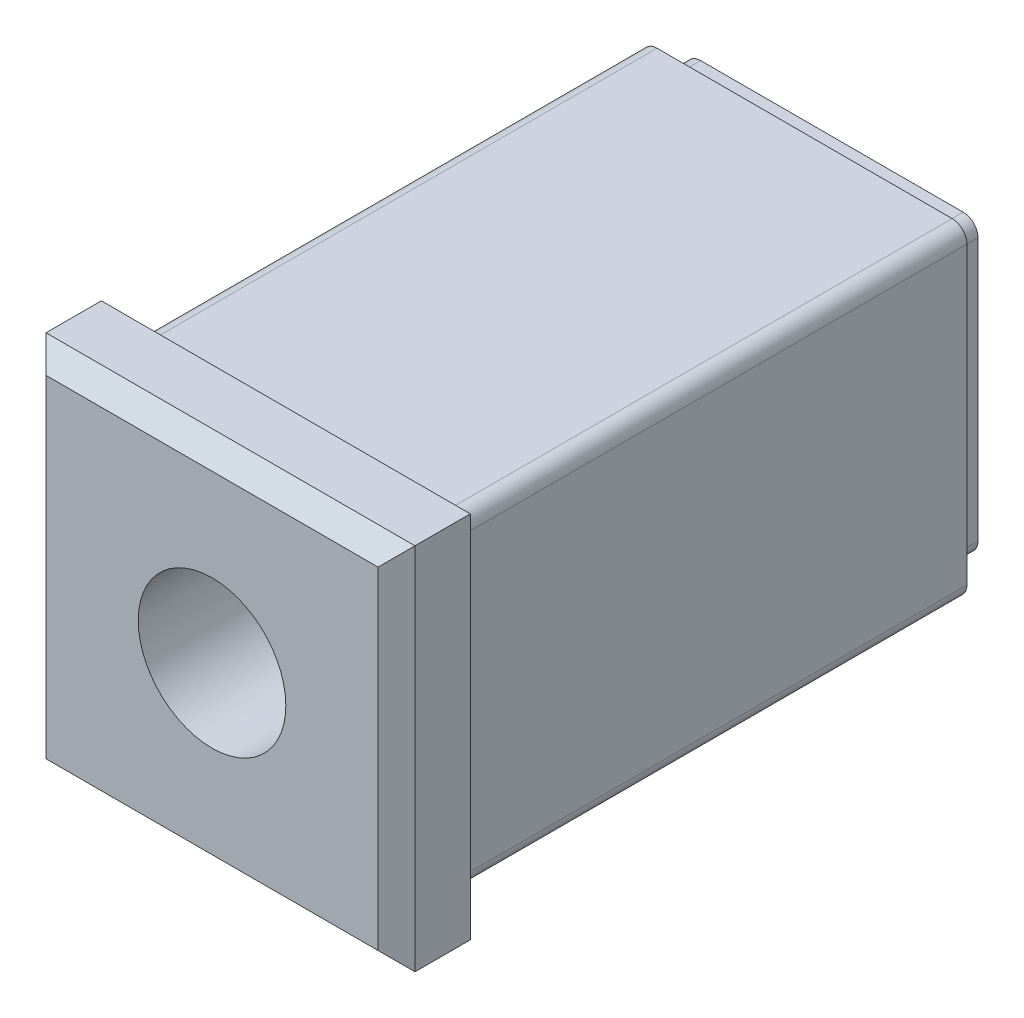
ISO-10303-21;
HEADER;
FILE_DESCRIPTION(('STEP AP214'),'2;1');
FILE_NAME('part.step','',(''),(''),'','','');
FILE_SCHEMA(('AUTOMOTIVE_DESIGN { 1 0 10303 214 1 1 1 1 }'));
ENDSEC;
DATA;
#1=APPLICATION_CONTEXT('core data for automotive mechanical design processes');
#2=APPLICATION_PROTOCOL_DEFINITION('international standard','automotive_design',2000,#1);
#3=PRODUCT_CONTEXT('',#1,'mechanical');
#4=PRODUCT('Part','Part','',(#3));
#5=PRODUCT_RELATED_PRODUCT_CATEGORY('part','',(#4));
#6=PRODUCT_DEFINITION_FORMATION('','',#4);
#7=PRODUCT_DEFINITION_CONTEXT('part definition',#1,'design');
#8=PRODUCT_DEFINITION('design','',#6,#7);
#9=PRODUCT_DEFINITION_SHAPE('','',#8);
#10=(LENGTH_UNIT() NAMED_UNIT(*) SI_UNIT(.MILLI.,.METRE.));
#11=(NAMED_UNIT(*) PLANE_ANGLE_UNIT() SI_UNIT($,.RADIAN.));
#12=(NAMED_UNIT(*) SI_UNIT($,.STERADIAN.) SOLID_ANGLE_UNIT());
#13=UNCERTAINTY_MEASURE_WITH_UNIT(LENGTH_MEASURE(1.E-05),#10,'distance_accuracy_value','');
#14=(GEOMETRIC_REPRESENTATION_CONTEXT(3) GLOBAL_UNCERTAINTY_ASSIGNED_CONTEXT((#13)) GLOBAL_UNIT_ASSIGNED_CONTEXT((#10,
#11,#12)) REPRESENTATION_CONTEXT('',''));
#15=CARTESIAN_POINT('',(0.,0.,0.));
#16=DIRECTION('',(0.,0.,1.));
#17=DIRECTION('',(1.,0.,0.));
#18=AXIS2_PLACEMENT_3D('',#15,#16,#17);
#19=CARTESIAN_POINT('',(11.25,0.,5.));
#20=DIRECTION('',(0.,0.,1.));
#21=DIRECTION('',(0.,1.,0.));
#22=AXIS2_PLACEMENT_3D('',#19,#20,#21);
#23=PLANE('',#22);
#24=DIRECTION('',(0.,-1.,0.));
#25=VECTOR('',#24,1.);
#26=CARTESIAN_POINT('',(-11.25,0.,5.));
#27=LINE('',#26,#25);
#28=CARTESIAN_POINT('',(-11.25,-11.25,5.));
#29=VERTEX_POINT('',#28);
#30=CARTESIAN_POINT('',(-11.25,11.25,5.));
#31=VERTEX_POINT('',#30);
#32=EDGE_CURVE('E237',#29,#31,#27,.F.);
#33=ORIENTED_EDGE('',*,*,#32,.F.);
#34=DIRECTION('',(-1.,0.,0.));
#35=VECTOR('',#34,1.);
#36=CARTESIAN_POINT('',(37.,-11.25,5.));
#37=LINE('',#36,#35);
#38=CARTESIAN_POINT('',(11.25,-11.25,5.));
#39=VERTEX_POINT('',#38);
#40=EDGE_CURVE('E188',#29,#39,#37,.F.);
#41=ORIENTED_EDGE('',*,*,#40,.T.);
#42=DIRECTION('',(0.,-1.,0.));
#43=VECTOR('',#42,1.);
#44=CARTESIAN_POINT('',(11.25,0.,5.));
#45=LINE('',#44,#43);
#46=CARTESIAN_POINT('',(11.25,11.25,5.));
#47=VERTEX_POINT('',#46);
#48=EDGE_CURVE('E347',#47,#39,#45,.T.);
#49=ORIENTED_EDGE('',*,*,#48,.F.);
#50=DIRECTION('',(-1.,0.,0.));
#51=VECTOR('',#50,1.);
#52=CARTESIAN_POINT('',(-25.,11.25,5.));
#53=LINE('',#52,#51);
#54=EDGE_CURVE('E360',#47,#31,#53,.T.);
#55=ORIENTED_EDGE('',*,*,#54,.T.);
#56=EDGE_LOOP('',(#33,#41,#49,#55));
#57=FACE_BOUND('',#56,.T.);
#58=CARTESIAN_POINT('',(0.,0.,5.));
#59=DIRECTION('',(0.,0.,1.));
#60=DIRECTION('',(0.,1.,0.));
#61=AXIS2_PLACEMENT_3D('',#58,#59,#60);
#62=CIRCLE('',#61,5.);
#63=CARTESIAN_POINT('',(0.,5.,5.));
#64=VERTEX_POINT('',#63);
#65=EDGE_CURVE('E191',#64,#64,#62,.F.);
#66=ORIENTED_EDGE('',*,*,#65,.T.);
#67=EDGE_LOOP('',(#66));
#68=FACE_BOUND('',#67,.T.);
#69=ADVANCED_FACE('F14',(#57,#68),#23,.T.);
#70=CARTESIAN_POINT('',(-25.,12.5,3.75));
#71=DIRECTION('',(0.,-0.707106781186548,-0.707106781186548));
#72=DIRECTION('',(0.,-0.707106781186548,0.707106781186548));
#73=AXIS2_PLACEMENT_3D('',#70,#71,#72);
#74=PLANE('',#73);
#75=DIRECTION('',(-1.,0.,0.));
#76=VECTOR('',#75,1.);
#77=CARTESIAN_POINT('',(0.,12.5,3.75));
#78=LINE('',#77,#76);
#79=CARTESIAN_POINT('',(12.5,12.5,3.75));
#80=VERTEX_POINT('',#79);
#81=CARTESIAN_POINT('',(-12.5,12.5,3.75));
#82=VERTEX_POINT('',#81);
#83=EDGE_CURVE('E338',#80,#82,#78,.T.);
#84=ORIENTED_EDGE('',*,*,#83,.T.);
#85=DIRECTION('',(-0.577350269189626,0.577350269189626,-0.577350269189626));
#86=VECTOR('',#85,1.);
#87=CARTESIAN_POINT('',(-11.25,11.25,5.));
#88=LINE('',#87,#86);
#89=EDGE_CURVE('E363',#31,#82,#88,.T.);
#90=ORIENTED_EDGE('',*,*,#89,.F.);
#91=ORIENTED_EDGE('',*,*,#54,.F.);
#92=DIRECTION('',(-0.577350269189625,-0.577350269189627,0.577350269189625));
#93=VECTOR('',#92,1.);
#94=CARTESIAN_POINT('',(12.5,12.5,3.75));
#95=LINE('',#94,#93);
#96=EDGE_CURVE('E349',#80,#47,#95,.T.);
#97=ORIENTED_EDGE('',*,*,#96,.F.);
#98=EDGE_LOOP('',(#84,#90,#91,#97));
#99=FACE_BOUND('',#98,.T.);
#100=ADVANCED_FACE('F441',(#99),#74,.F.);
#101=CARTESIAN_POINT('',(-11.25,0.,5.));
#102=DIRECTION('',(-0.707106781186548,0.,0.707106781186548));
#103=DIRECTION('',(-0.707106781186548,0.,-0.707106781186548));
#104=AXIS2_PLACEMENT_3D('',#101,#102,#103);
#105=PLANE('',#104);
#106=DIRECTION('',(0.,1.,0.));
#107=VECTOR('',#106,1.);
#108=CARTESIAN_POINT('',(-12.5,0.,3.75));
#109=LINE('',#108,#107);
#110=CARTESIAN_POINT('',(-12.5,-12.5,3.75));
#111=VERTEX_POINT('',#110);
#112=EDGE_CURVE('E18',#111,#82,#109,.T.);
#113=ORIENTED_EDGE('',*,*,#112,.F.);
#114=DIRECTION('',(0.577350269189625,0.577350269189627,0.577350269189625));
#115=VECTOR('',#114,1.);
#116=CARTESIAN_POINT('',(-12.5,-12.5,3.75));
#117=LINE('',#116,#115);
#118=EDGE_CURVE('E164',#111,#29,#117,.T.);
#119=ORIENTED_EDGE('',*,*,#118,.T.);
#120=ORIENTED_EDGE('',*,*,#32,.T.);
#121=ORIENTED_EDGE('',*,*,#89,.T.);
#122=EDGE_LOOP('',(#113,#119,#120,#121));
#123=FACE_BOUND('',#122,.T.);
#124=ADVANCED_FACE('F443',(#123),#105,.T.);
#125=CARTESIAN_POINT('',(12.5,0.,3.75));
#126=DIRECTION('',(0.707106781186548,0.,0.707106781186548));
#127=DIRECTION('',(-0.707106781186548,0.,0.707106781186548));
#128=AXIS2_PLACEMENT_3D('',#125,#126,#127);
#129=PLANE('',#128);
#130=ORIENTED_EDGE('',*,*,#48,.T.);
#131=DIRECTION('',(0.577350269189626,-0.577350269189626,-0.577350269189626));
#132=VECTOR('',#131,1.);
#133=CARTESIAN_POINT('',(11.25,-11.25,5.));
#134=LINE('',#133,#132);
#135=CARTESIAN_POINT('',(12.5,-12.5,3.75));
#136=VERTEX_POINT('',#135);
#137=EDGE_CURVE('E187',#39,#136,#134,.T.);
#138=ORIENTED_EDGE('',*,*,#137,.T.);
#139=DIRECTION('',(0.,-1.,0.));
#140=VECTOR('',#139,1.);
#141=CARTESIAN_POINT('',(12.5,0.,3.75));
#142=LINE('',#141,#140);
#143=EDGE_CURVE('E333',#80,#136,#142,.T.);
#144=ORIENTED_EDGE('',*,*,#143,.F.);
#145=ORIENTED_EDGE('',*,*,#96,.T.);
#146=EDGE_LOOP('',(#130,#138,#144,#145));
#147=FACE_BOUND('',#146,.T.);
#148=ADVANCED_FACE('F446',(#147),#129,.T.);
#149=CARTESIAN_POINT('',(-12.5,0.,-37.));
#150=DIRECTION('',(0.,0.,-1.));
#151=DIRECTION('',(0.,-1.,0.));
#152=AXIS2_PLACEMENT_3D('',#149,#150,#151);
#153=PLANE('',#152);
#154=DIRECTION('',(-1.,0.,0.));
#155=VECTOR('',#154,1.);
#156=CARTESIAN_POINT('',(-8.9,9.9,-37.));
#157=LINE('',#156,#155);
#158=CARTESIAN_POINT('',(-8.9,9.9,-37.));
#159=VERTEX_POINT('',#158);
#160=CARTESIAN_POINT('',(8.9,9.9,-37.));
#161=VERTEX_POINT('',#160);
#162=EDGE_CURVE('E322',#159,#161,#157,.F.);
#163=ORIENTED_EDGE('',*,*,#162,.T.);
#164=CARTESIAN_POINT('',(8.9,8.9,-37.));
#165=DIRECTION('',(0.,0.,1.));
#166=DIRECTION('',(0.,1.,0.));
#167=AXIS2_PLACEMENT_3D('',#164,#165,#166);
#168=CIRCLE('',#167,1.);
#169=CARTESIAN_POINT('',(9.9,8.9,-37.));
#170=VERTEX_POINT('',#169);
#171=EDGE_CURVE('E375',#161,#170,#168,.F.);
#172=ORIENTED_EDGE('',*,*,#171,.T.);
#173=DIRECTION('',(0.,1.,0.));
#174=VECTOR('',#173,1.);
#175=CARTESIAN_POINT('',(9.9,8.9,-37.));
#176=LINE('',#175,#174);
#177=CARTESIAN_POINT('',(9.9,-8.9,-37.));
#178=VERTEX_POINT('',#177);
#179=EDGE_CURVE('E327',#170,#178,#176,.F.);
#180=ORIENTED_EDGE('',*,*,#179,.T.);
#181=CARTESIAN_POINT('',(8.9,-8.9,-37.));
#182=DIRECTION('',(0.,0.,1.));
#183=DIRECTION('',(0.,1.,0.));
#184=AXIS2_PLACEMENT_3D('',#181,#182,#183);
#185=CIRCLE('',#184,1.);
#186=CARTESIAN_POINT('',(8.9,-9.9,-37.));
#187=VERTEX_POINT('',#186);
#188=EDGE_CURVE('E211',#178,#187,#185,.F.);
#189=ORIENTED_EDGE('',*,*,#188,.T.);
#190=DIRECTION('',(1.,0.,0.));
#191=VECTOR('',#190,1.);
#192=CARTESIAN_POINT('',(8.9,-9.9,-37.));
#193=LINE('',#192,#191);
#194=CARTESIAN_POINT('',(-8.9,-9.9,-37.));
#195=VERTEX_POINT('',#194);
#196=EDGE_CURVE('E181',#187,#195,#193,.F.);
#197=ORIENTED_EDGE('',*,*,#196,.T.);
#198=CARTESIAN_POINT('',(-8.9,-8.9,-37.));
#199=DIRECTION('',(0.,0.,1.));
#200=DIRECTION('',(0.,1.,0.));
#201=AXIS2_PLACEMENT_3D('',#198,#199,#200);
#202=CIRCLE('',#201,1.);
#203=CARTESIAN_POINT('',(-9.9,-8.9,-37.));
#204=VERTEX_POINT('',#203);
#205=EDGE_CURVE('E193',#195,#204,#202,.F.);
#206=ORIENTED_EDGE('',*,*,#205,.T.);
#207=DIRECTION('',(0.,-1.,0.));
#208=VECTOR('',#207,1.);
#209=CARTESIAN_POINT('',(-9.9,-8.9,-37.));
#210=LINE('',#209,#208);
#211=CARTESIAN_POINT('',(-9.9,8.9,-37.));
#212=VERTEX_POINT('',#211);
#213=EDGE_CURVE('E167',#204,#212,#210,.F.);
#214=ORIENTED_EDGE('',*,*,#213,.T.);
#215=CARTESIAN_POINT('',(-8.9,8.9,-37.));
#216=DIRECTION('',(0.,0.,1.));
#217=DIRECTION('',(0.,1.,0.));
#218=AXIS2_PLACEMENT_3D('',#215,#216,#217);
#219=CIRCLE('',#218,1.);
#220=EDGE_CURVE('E377',#212,#159,#219,.F.);
#221=ORIENTED_EDGE('',*,*,#220,.T.);
#222=EDGE_LOOP('',(#163,#172,#180,#189,#197,#206,#214,#221));
#223=FACE_BOUND('',#222,.T.);
#224=CARTESIAN_POINT('',(0.,0.,-37.));
#225=DIRECTION('',(0.,0.,-1.));
#226=DIRECTION('',(0.,-1.,0.));
#227=AXIS2_PLACEMENT_3D('',#224,#225,#226);
#228=CIRCLE('',#227,5.);
#229=CARTESIAN_POINT('',(0.,-5.,-37.));
#230=VERTEX_POINT('',#229);
#231=EDGE_CURVE('E651',#230,#230,#228,.T.);
#232=ORIENTED_EDGE('',*,*,#231,.F.);
#233=EDGE_LOOP('',(#232));
#234=FACE_BOUND('',#233,.T.);
#235=ADVANCED_FACE('F389',(#223,#234),#153,.T.);
#236=CARTESIAN_POINT('',(12.5,0.,-37.));
#237=DIRECTION('',(1.,0.,0.));
#238=DIRECTION('',(0.,-1.,0.));
#239=AXIS2_PLACEMENT_3D('',#236,#237,#238);
#240=PLANE('',#239);
#241=ORIENTED_EDGE('',*,*,#143,.T.);
#242=DIRECTION('',(0.,0.,-1.));
#243=VECTOR('',#242,1.);
#244=CARTESIAN_POINT('',(12.5,-12.5,5.));
#245=LINE('',#244,#243);
#246=CARTESIAN_POINT('',(12.5,-12.5,0.));
#247=VERTEX_POINT('',#246);
#248=EDGE_CURVE('E174',#136,#247,#245,.T.);
#249=ORIENTED_EDGE('',*,*,#248,.T.);
#250=DIRECTION('',(0.,-1.,0.));
#251=VECTOR('',#250,1.);
#252=CARTESIAN_POINT('',(12.5,0.,0.));
#253=LINE('',#252,#251);
#254=CARTESIAN_POINT('',(12.5,12.5,0.));
#255=VERTEX_POINT('',#254);
#256=EDGE_CURVE('E309',#255,#247,#253,.T.);
#257=ORIENTED_EDGE('',*,*,#256,.F.);
#258=DIRECTION('',(0.,0.,-1.));
#259=VECTOR('',#258,1.);
#260=CARTESIAN_POINT('',(12.5,12.5,-37.));
#261=LINE('',#260,#259);
#262=EDGE_CURVE('E337',#255,#80,#261,.F.);
#263=ORIENTED_EDGE('',*,*,#262,.T.);
#264=EDGE_LOOP('',(#241,#249,#257,#263));
#265=FACE_BOUND('',#264,.T.);
#266=ADVANCED_FACE('F467',(#265),#240,.T.);
#267=CARTESIAN_POINT('',(0.,12.5,5.));
#268=DIRECTION('',(0.,-1.,0.));
#269=DIRECTION('',(-1.,0.,0.));
#270=AXIS2_PLACEMENT_3D('',#267,#268,#269);
#271=PLANE('',#270);
#272=DIRECTION('',(0.,0.,-1.));
#273=VECTOR('',#272,1.);
#274=CARTESIAN_POINT('',(-12.5,12.5,5.));
#275=LINE('',#274,#273);
#276=CARTESIAN_POINT('',(-12.5,12.5,0.));
#277=VERTEX_POINT('',#276);
#278=EDGE_CURVE('E334',#82,#277,#275,.T.);
#279=ORIENTED_EDGE('',*,*,#278,.F.);
#280=ORIENTED_EDGE('',*,*,#83,.F.);
#281=ORIENTED_EDGE('',*,*,#262,.F.);
#282=DIRECTION('',(-1.,0.,0.));
#283=VECTOR('',#282,1.);
#284=CARTESIAN_POINT('',(0.,12.5,0.));
#285=LINE('',#284,#283);
#286=EDGE_CURVE('E312',#277,#255,#285,.F.);
#287=ORIENTED_EDGE('',*,*,#286,.F.);
#288=EDGE_LOOP('',(#279,#280,#281,#287));
#289=FACE_BOUND('',#288,.T.);
#290=ADVANCED_FACE('F470',(#289),#271,.F.);
#291=CARTESIAN_POINT('',(-12.5,0.,3.75));
#292=DIRECTION('',(-1.,0.,0.));
#293=DIRECTION('',(0.,1.,0.));
#294=AXIS2_PLACEMENT_3D('',#291,#292,#293);
#295=PLANE('',#294);
#296=ORIENTED_EDGE('',*,*,#112,.T.);
#297=ORIENTED_EDGE('',*,*,#278,.T.);
#298=DIRECTION('',(0.,-1.,0.));
#299=VECTOR('',#298,1.);
#300=CARTESIAN_POINT('',(-12.5,0.,0.));
#301=LINE('',#300,#299);
#302=CARTESIAN_POINT('',(-12.5,-12.5,0.));
#303=VERTEX_POINT('',#302);
#304=EDGE_CURVE('E315',#303,#277,#301,.F.);
#305=ORIENTED_EDGE('',*,*,#304,.F.);
#306=DIRECTION('',(0.,0.,-1.));
#307=VECTOR('',#306,1.);
#308=CARTESIAN_POINT('',(-12.5,-12.5,-37.));
#309=LINE('',#308,#307);
#310=EDGE_CURVE('E169',#303,#111,#309,.F.);
#311=ORIENTED_EDGE('',*,*,#310,.T.);
#312=EDGE_LOOP('',(#296,#297,#305,#311));
#313=FACE_BOUND('',#312,.T.);
#314=ADVANCED_FACE('F474',(#313),#295,.T.);
#315=CARTESIAN_POINT('',(-10.,11.,0.));
#316=DIRECTION('',(0.,-1.,0.));
#317=DIRECTION('',(-1.,0.,0.));
#318=AXIS2_PLACEMENT_3D('',#315,#316,#317);
#319=PLANE('',#318);
#320=DIRECTION('',(0.,0.,-1.));
#321=VECTOR('',#320,1.);
#322=CARTESIAN_POINT('',(-10.,11.,0.));
#323=LINE('',#322,#321);
#324=CARTESIAN_POINT('',(-10.,11.,0.));
#325=VERTEX_POINT('',#324);
#326=CARTESIAN_POINT('',(-10.,11.,-35.15));
#327=VERTEX_POINT('',#326);
#328=EDGE_CURVE('E24',#325,#327,#323,.T.);
#329=ORIENTED_EDGE('',*,*,#328,.F.);
#330=DIRECTION('',(-1.,0.,0.));
#331=VECTOR('',#330,1.);
#332=CARTESIAN_POINT('',(-10.,11.,0.));
#333=LINE('',#332,#331);
#334=CARTESIAN_POINT('',(10.,11.,0.));
#335=VERTEX_POINT('',#334);
#336=EDGE_CURVE('E279',#335,#325,#333,.T.);
#337=ORIENTED_EDGE('',*,*,#336,.F.);
#338=DIRECTION('',(0.,0.,-1.));
#339=VECTOR('',#338,1.);
#340=CARTESIAN_POINT('',(10.,11.,0.));
#341=LINE('',#340,#339);
#342=CARTESIAN_POINT('',(10.,11.,-35.15));
#343=VERTEX_POINT('',#342);
#344=EDGE_CURVE('E276',#343,#335,#341,.F.);
#345=ORIENTED_EDGE('',*,*,#344,.F.);
#346=DIRECTION('',(-1.,0.,0.));
#347=VECTOR('',#346,1.);
#348=CARTESIAN_POINT('',(-10.,11.,-35.15));
#349=LINE('',#348,#347);
#350=EDGE_CURVE('E9',#327,#343,#349,.F.);
#351=ORIENTED_EDGE('',*,*,#350,.F.);
#352=EDGE_LOOP('',(#329,#337,#345,#351));
#353=FACE_BOUND('',#352,.T.);
#354=ADVANCED_FACE('F477',(#353),#319,.F.);
#355=CARTESIAN_POINT('',(-10.,10.,0.));
#356=DIRECTION('',(0.,0.,1.));
#357=DIRECTION('',(0.,1.,0.));
#358=AXIS2_PLACEMENT_3D('',#355,#356,#357);
#359=CYLINDRICAL_SURFACE('',#358,1.);
#360=CARTESIAN_POINT('',(-10.,10.,0.));
#361=DIRECTION('',(0.,0.,1.));
#362=DIRECTION('',(0.,1.,0.));
#363=AXIS2_PLACEMENT_3D('',#360,#361,#362);
#364=CIRCLE('',#363,1.);
#365=CARTESIAN_POINT('',(-11.,10.,0.));
#366=VERTEX_POINT('',#365);
#367=EDGE_CURVE('E295',#366,#325,#364,.F.);
#368=ORIENTED_EDGE('',*,*,#367,.T.);
#369=ORIENTED_EDGE('',*,*,#328,.T.);
#370=CARTESIAN_POINT('',(-10.,10.,-35.15));
#371=DIRECTION('',(0.,0.,1.));
#372=DIRECTION('',(0.,1.,0.));
#373=AXIS2_PLACEMENT_3D('',#370,#371,#372);
#374=CIRCLE('',#373,1.);
#375=CARTESIAN_POINT('',(-11.,10.,-35.15));
#376=VERTEX_POINT('',#375);
#377=EDGE_CURVE('E32',#376,#327,#374,.F.);
#378=ORIENTED_EDGE('',*,*,#377,.F.);
#379=DIRECTION('',(0.,0.,1.));
#380=VECTOR('',#379,1.);
#381=CARTESIAN_POINT('',(-11.,10.,0.));
#382=LINE('',#381,#380);
#383=EDGE_CURVE('E304',#376,#366,#382,.T.);
#384=ORIENTED_EDGE('',*,*,#383,.T.);
#385=EDGE_LOOP('',(#368,#369,#378,#384));
#386=FACE_BOUND('',#385,.T.);
#387=ADVANCED_FACE('F512',(#386),#359,.T.);
#388=CARTESIAN_POINT('',(-11.,-10.,0.));
#389=DIRECTION('',(1.,0.,0.));
#390=DIRECTION('',(0.,-1.,0.));
#391=AXIS2_PLACEMENT_3D('',#388,#389,#390);
#392=PLANE('',#391);
#393=DIRECTION('',(0.,-1.,0.));
#394=VECTOR('',#393,1.);
#395=CARTESIAN_POINT('',(-11.,0.,-35.15));
#396=LINE('',#395,#394);
#397=CARTESIAN_POINT('',(-11.,-10.,-35.15));
#398=VERTEX_POINT('',#397);
#399=EDGE_CURVE('E153',#398,#376,#396,.F.);
#400=ORIENTED_EDGE('',*,*,#399,.F.);
#401=DIRECTION('',(0.,0.,1.));
#402=VECTOR('',#401,1.);
#403=CARTESIAN_POINT('',(-11.,-10.,0.));
#404=LINE('',#403,#402);
#405=CARTESIAN_POINT('',(-11.,-10.,0.));
#406=VERTEX_POINT('',#405);
#407=EDGE_CURVE('E244',#406,#398,#404,.F.);
#408=ORIENTED_EDGE('',*,*,#407,.F.);
#409=DIRECTION('',(0.,-1.,0.));
#410=VECTOR('',#409,1.);
#411=CARTESIAN_POINT('',(-11.,0.,0.));
#412=LINE('',#411,#410);
#413=EDGE_CURVE('E302',#366,#406,#412,.T.);
#414=ORIENTED_EDGE('',*,*,#413,.F.);
#415=ORIENTED_EDGE('',*,*,#383,.F.);
#416=EDGE_LOOP('',(#400,#408,#414,#415));
#417=FACE_BOUND('',#416,.T.);
#418=ADVANCED_FACE('F405',(#417),#392,.F.);
#419=CARTESIAN_POINT('',(-9.9,-8.9,-35.15));
#420=DIRECTION('',(1.,0.,0.));
#421=DIRECTION('',(0.,-1.,0.));
#422=AXIS2_PLACEMENT_3D('',#419,#420,#421);
#423=PLANE('',#422);
#424=ORIENTED_EDGE('',*,*,#213,.F.);
#425=DIRECTION('',(0.,0.,-1.));
#426=VECTOR('',#425,1.);
#427=CARTESIAN_POINT('',(-9.9,-8.9,-35.15));
#428=LINE('',#427,#426);
#429=CARTESIAN_POINT('',(-9.9,-8.9,-35.15));
#430=VERTEX_POINT('',#429);
#431=EDGE_CURVE('E160',#430,#204,#428,.T.);
#432=ORIENTED_EDGE('',*,*,#431,.F.);
#433=DIRECTION('',(0.,-1.,0.));
#434=VECTOR('',#433,1.);
#435=CARTESIAN_POINT('',(-9.9,0.,-35.15));
#436=LINE('',#435,#434);
#437=CARTESIAN_POINT('',(-9.9,8.9,-35.15));
#438=VERTEX_POINT('',#437);
#439=EDGE_CURVE('E146',#438,#430,#436,.T.);
#440=ORIENTED_EDGE('',*,*,#439,.F.);
#441=DIRECTION('',(0.,0.,-1.));
#442=VECTOR('',#441,1.);
#443=CARTESIAN_POINT('',(-9.9,8.9,-35.15));
#444=LINE('',#443,#442);
#445=EDGE_CURVE('E320',#212,#438,#444,.F.);
#446=ORIENTED_EDGE('',*,*,#445,.F.);
#447=EDGE_LOOP('',(#424,#432,#440,#446));
#448=FACE_BOUND('',#447,.T.);
#449=ADVANCED_FACE('F165',(#448),#423,.F.);
#450=CARTESIAN_POINT('',(-8.9,8.9,-35.15));
#451=DIRECTION('',(0.,0.,1.));
#452=DIRECTION('',(0.,1.,0.));
#453=AXIS2_PLACEMENT_3D('',#450,#451,#452);
#454=CYLINDRICAL_SURFACE('',#453,1.);
#455=CARTESIAN_POINT('',(-8.9,8.9,-35.15));
#456=DIRECTION('',(0.,0.,1.));
#457=DIRECTION('',(0.,1.,0.));
#458=AXIS2_PLACEMENT_3D('',#455,#456,#457);
#459=CIRCLE('',#458,1.);
#460=CARTESIAN_POINT('',(-8.9,9.9,-35.15));
#461=VERTEX_POINT('',#460);
#462=EDGE_CURVE('E149',#438,#461,#459,.F.);
#463=ORIENTED_EDGE('',*,*,#462,.T.);
#464=DIRECTION('',(0.,0.,-1.));
#465=VECTOR('',#464,1.);
#466=CARTESIAN_POINT('',(-8.9,9.9,-35.15));
#467=LINE('',#466,#465);
#468=EDGE_CURVE('E326',#461,#159,#467,.T.);
#469=ORIENTED_EDGE('',*,*,#468,.T.);
#470=ORIENTED_EDGE('',*,*,#220,.F.);
#471=ORIENTED_EDGE('',*,*,#445,.T.);
#472=EDGE_LOOP('',(#463,#469,#470,#471));
#473=FACE_BOUND('',#472,.T.);
#474=ADVANCED_FACE('F395',(#473),#454,.T.);
#475=CARTESIAN_POINT('',(-8.9,9.9,-35.15));
#476=DIRECTION('',(0.,-1.,0.));
#477=DIRECTION('',(-1.,0.,0.));
#478=AXIS2_PLACEMENT_3D('',#475,#476,#477);
#479=PLANE('',#478);
#480=ORIENTED_EDGE('',*,*,#468,.F.);
#481=DIRECTION('',(-1.,0.,0.));
#482=VECTOR('',#481,1.);
#483=CARTESIAN_POINT('',(0.,9.9,-35.15));
#484=LINE('',#483,#482);
#485=CARTESIAN_POINT('',(8.9,9.9,-35.15));
#486=VERTEX_POINT('',#485);
#487=EDGE_CURVE('E154',#486,#461,#484,.T.);
#488=ORIENTED_EDGE('',*,*,#487,.F.);
#489=DIRECTION('',(0.,0.,-1.));
#490=VECTOR('',#489,1.);
#491=CARTESIAN_POINT('',(8.9,9.9,-35.15));
#492=LINE('',#491,#490);
#493=EDGE_CURVE('E323',#161,#486,#492,.F.);
#494=ORIENTED_EDGE('',*,*,#493,.F.);
#495=ORIENTED_EDGE('',*,*,#162,.F.);
#496=EDGE_LOOP('',(#480,#488,#494,#495));
#497=FACE_BOUND('',#496,.T.);
#498=ADVANCED_FACE('F394',(#497),#479,.F.);
#499=CARTESIAN_POINT('',(8.9,8.9,-35.15));
#500=DIRECTION('',(0.,0.,1.));
#501=DIRECTION('',(0.,1.,0.));
#502=AXIS2_PLACEMENT_3D('',#499,#500,#501);
#503=CYLINDRICAL_SURFACE('',#502,1.);
#504=CARTESIAN_POINT('',(8.9,8.9,-35.15));
#505=DIRECTION('',(0.,0.,1.));
#506=DIRECTION('',(0.,1.,0.));
#507=AXIS2_PLACEMENT_3D('',#504,#505,#506);
#508=CIRCLE('',#507,1.);
#509=CARTESIAN_POINT('',(9.9,8.9,-35.15));
#510=VERTEX_POINT('',#509);
#511=EDGE_CURVE('E228',#486,#510,#508,.F.);
#512=ORIENTED_EDGE('',*,*,#511,.T.);
#513=DIRECTION('',(0.,0.,-1.));
#514=VECTOR('',#513,1.);
#515=CARTESIAN_POINT('',(9.9,8.9,-35.15));
#516=LINE('',#515,#514);
#517=EDGE_CURVE('E330',#510,#170,#516,.T.);
#518=ORIENTED_EDGE('',*,*,#517,.T.);
#519=ORIENTED_EDGE('',*,*,#171,.F.);
#520=ORIENTED_EDGE('',*,*,#493,.T.);
#521=EDGE_LOOP('',(#512,#518,#519,#520));
#522=FACE_BOUND('',#521,.T.);
#523=ADVANCED_FACE('F382',(#522),#503,.T.);
#524=CARTESIAN_POINT('',(9.9,8.9,-35.15));
#525=DIRECTION('',(-1.,0.,0.));
#526=DIRECTION('',(0.,1.,0.));
#527=AXIS2_PLACEMENT_3D('',#524,#525,#526);
#528=PLANE('',#527);
#529=ORIENTED_EDGE('',*,*,#517,.F.);
#530=DIRECTION('',(0.,-1.,0.));
#531=VECTOR('',#530,1.);
#532=CARTESIAN_POINT('',(9.9,0.,-35.15));
#533=LINE('',#532,#531);
#534=CARTESIAN_POINT('',(9.9,-8.9,-35.15));
#535=VERTEX_POINT('',#534);
#536=EDGE_CURVE('E293',#535,#510,#533,.F.);
#537=ORIENTED_EDGE('',*,*,#536,.F.);
#538=DIRECTION('',(0.,0.,-1.));
#539=VECTOR('',#538,1.);
#540=CARTESIAN_POINT('',(9.9,-8.9,-35.15));
#541=LINE('',#540,#539);
#542=EDGE_CURVE('E184',#178,#535,#541,.F.);
#543=ORIENTED_EDGE('',*,*,#542,.F.);
#544=ORIENTED_EDGE('',*,*,#179,.F.);
#545=EDGE_LOOP('',(#529,#537,#543,#544));
#546=FACE_BOUND('',#545,.T.);
#547=ADVANCED_FACE('F387',(#546),#528,.F.);
#548=CARTESIAN_POINT('',(11.,10.,0.));
#549=DIRECTION('',(-1.,0.,0.));
#550=DIRECTION('',(0.,1.,0.));
#551=AXIS2_PLACEMENT_3D('',#548,#549,#550);
#552=PLANE('',#551);
#553=DIRECTION('',(0.,0.,1.));
#554=VECTOR('',#553,1.);
#555=CARTESIAN_POINT('',(11.,10.,0.));
#556=LINE('',#555,#554);
#557=CARTESIAN_POINT('',(11.,10.,0.));
#558=VERTEX_POINT('',#557);
#559=CARTESIAN_POINT('',(11.,10.,-35.15));
#560=VERTEX_POINT('',#559);
#561=EDGE_CURVE('E316',#558,#560,#556,.F.);
#562=ORIENTED_EDGE('',*,*,#561,.F.);
#563=DIRECTION('',(0.,-1.,0.));
#564=VECTOR('',#563,1.);
#565=CARTESIAN_POINT('',(11.,0.,0.));
#566=LINE('',#565,#564);
#567=CARTESIAN_POINT('',(11.,-10.,0.));
#568=VERTEX_POINT('',#567);
#569=EDGE_CURVE('E260',#568,#558,#566,.F.);
#570=ORIENTED_EDGE('',*,*,#569,.F.);
#571=DIRECTION('',(0.,0.,1.));
#572=VECTOR('',#571,1.);
#573=CARTESIAN_POINT('',(11.,-10.,0.));
#574=LINE('',#573,#572);
#575=CARTESIAN_POINT('',(11.,-10.,-35.15));
#576=VERTEX_POINT('',#575);
#577=EDGE_CURVE('E206',#576,#568,#574,.T.);
#578=ORIENTED_EDGE('',*,*,#577,.F.);
#579=DIRECTION('',(0.,-1.,0.));
#580=VECTOR('',#579,1.);
#581=CARTESIAN_POINT('',(11.,0.,-35.15));
#582=LINE('',#581,#580);
#583=EDGE_CURVE('E272',#560,#576,#582,.T.);
#584=ORIENTED_EDGE('',*,*,#583,.F.);
#585=EDGE_LOOP('',(#562,#570,#578,#584));
#586=FACE_BOUND('',#585,.T.);
#587=ADVANCED_FACE('F458',(#586),#552,.F.);
#588=CARTESIAN_POINT('',(10.,10.,0.));
#589=DIRECTION('',(0.,0.,1.));
#590=DIRECTION('',(0.,1.,0.));
#591=AXIS2_PLACEMENT_3D('',#588,#589,#590);
#592=CYLINDRICAL_SURFACE('',#591,1.);
#593=CARTESIAN_POINT('',(10.,10.,0.));
#594=DIRECTION('',(0.,0.,1.));
#595=DIRECTION('',(0.,1.,0.));
#596=AXIS2_PLACEMENT_3D('',#593,#594,#595);
#597=CIRCLE('',#596,1.);
#598=EDGE_CURVE('E305',#558,#335,#597,.T.);
#599=ORIENTED_EDGE('',*,*,#598,.F.);
#600=ORIENTED_EDGE('',*,*,#561,.T.);
#601=CARTESIAN_POINT('',(10.,10.,-35.15));
#602=DIRECTION('',(0.,0.,1.));
#603=DIRECTION('',(0.,1.,0.));
#604=AXIS2_PLACEMENT_3D('',#601,#602,#603);
#605=CIRCLE('',#604,1.);
#606=EDGE_CURVE('E275',#343,#560,#605,.F.);
#607=ORIENTED_EDGE('',*,*,#606,.F.);
#608=ORIENTED_EDGE('',*,*,#344,.T.);
#609=EDGE_LOOP('',(#599,#600,#607,#608));
#610=FACE_BOUND('',#609,.T.);
#611=ADVANCED_FACE('F464',(#610),#592,.T.);
#612=CARTESIAN_POINT('',(0.,0.,-35.15));
#613=DIRECTION('',(0.,0.,-1.));
#614=DIRECTION('',(0.,-1.,0.));
#615=AXIS2_PLACEMENT_3D('',#612,#613,#614);
#616=PLANE('',#615);
#617=ORIENTED_EDGE('',*,*,#439,.T.);
#618=CARTESIAN_POINT('',(-8.9,-8.9,-35.15));
#619=DIRECTION('',(0.,0.,1.));
#620=DIRECTION('',(0.,1.,0.));
#621=AXIS2_PLACEMENT_3D('',#618,#619,#620);
#622=CIRCLE('',#621,1.);
#623=CARTESIAN_POINT('',(-8.9,-9.9,-35.15));
#624=VERTEX_POINT('',#623);
#625=EDGE_CURVE('E143',#624,#430,#622,.F.);
#626=ORIENTED_EDGE('',*,*,#625,.F.);
#627=DIRECTION('',(-1.,0.,0.));
#628=VECTOR('',#627,1.);
#629=CARTESIAN_POINT('',(0.,-9.9,-35.15));
#630=LINE('',#629,#628);
#631=CARTESIAN_POINT('',(8.9,-9.9,-35.15));
#632=VERTEX_POINT('',#631);
#633=EDGE_CURVE('E203',#624,#632,#630,.F.);
#634=ORIENTED_EDGE('',*,*,#633,.T.);
#635=CARTESIAN_POINT('',(8.9,-8.9,-35.15));
#636=DIRECTION('',(0.,0.,1.));
#637=DIRECTION('',(0.,1.,0.));
#638=AXIS2_PLACEMENT_3D('',#635,#636,#637);
#639=CIRCLE('',#638,1.);
#640=EDGE_CURVE('E163',#535,#632,#639,.F.);
#641=ORIENTED_EDGE('',*,*,#640,.F.);
#642=ORIENTED_EDGE('',*,*,#536,.T.);
#643=ORIENTED_EDGE('',*,*,#511,.F.);
#644=ORIENTED_EDGE('',*,*,#487,.T.);
#645=ORIENTED_EDGE('',*,*,#462,.F.);
#646=EDGE_LOOP('',(#617,#626,#634,#641,#642,#643,#644,#645));
#647=FACE_BOUND('',#646,.T.);
#648=ORIENTED_EDGE('',*,*,#606,.T.);
#649=ORIENTED_EDGE('',*,*,#583,.T.);
#650=CARTESIAN_POINT('',(10.,-10.,-35.15));
#651=DIRECTION('',(0.,0.,1.));
#652=DIRECTION('',(0.,1.,0.));
#653=AXIS2_PLACEMENT_3D('',#650,#651,#652);
#654=CIRCLE('',#653,1.);
#655=CARTESIAN_POINT('',(10.,-11.,-35.15));
#656=VERTEX_POINT('',#655);
#657=EDGE_CURVE('E201',#576,#656,#654,.F.);
#658=ORIENTED_EDGE('',*,*,#657,.T.);
#659=DIRECTION('',(1.,0.,0.));
#660=VECTOR('',#659,1.);
#661=CARTESIAN_POINT('',(10.,-11.,-35.15));
#662=LINE('',#661,#660);
#663=CARTESIAN_POINT('',(-10.,-11.,-35.15));
#664=VERTEX_POINT('',#663);
#665=EDGE_CURVE('E233',#656,#664,#662,.F.);
#666=ORIENTED_EDGE('',*,*,#665,.T.);
#667=CARTESIAN_POINT('',(-10.,-10.,-35.15));
#668=DIRECTION('',(0.,0.,1.));
#669=DIRECTION('',(0.,1.,0.));
#670=AXIS2_PLACEMENT_3D('',#667,#668,#669);
#671=CIRCLE('',#670,1.);
#672=EDGE_CURVE('E197',#664,#398,#671,.F.);
#673=ORIENTED_EDGE('',*,*,#672,.T.);
#674=ORIENTED_EDGE('',*,*,#399,.T.);
#675=ORIENTED_EDGE('',*,*,#377,.T.);
#676=ORIENTED_EDGE('',*,*,#350,.T.);
#677=EDGE_LOOP('',(#648,#649,#658,#666,#673,#674,#675,#676));
#678=FACE_BOUND('',#677,.T.);
#679=ADVANCED_FACE('F147',(#647,#678),#616,.T.);
#680=CARTESIAN_POINT('',(0.,0.,0.));
#681=DIRECTION('',(0.,0.,-1.));
#682=DIRECTION('',(0.,-1.,0.));
#683=AXIS2_PLACEMENT_3D('',#680,#681,#682);
#684=PLANE('',#683);
#685=ORIENTED_EDGE('',*,*,#413,.T.);
#686=CARTESIAN_POINT('',(-10.,-10.,0.));
#687=DIRECTION('',(0.,0.,1.));
#688=DIRECTION('',(0.,1.,0.));
#689=AXIS2_PLACEMENT_3D('',#686,#687,#688);
#690=CIRCLE('',#689,1.);
#691=CARTESIAN_POINT('',(-10.,-11.,0.));
#692=VERTEX_POINT('',#691);
#693=EDGE_CURVE('E207',#406,#692,#690,.T.);
#694=ORIENTED_EDGE('',*,*,#693,.T.);
#695=DIRECTION('',(1.,0.,0.));
#696=VECTOR('',#695,1.);
#697=CARTESIAN_POINT('',(10.,-11.,0.));
#698=LINE('',#697,#696);
#699=CARTESIAN_POINT('',(10.,-11.,0.));
#700=VERTEX_POINT('',#699);
#701=EDGE_CURVE('E234',#692,#700,#698,.T.);
#702=ORIENTED_EDGE('',*,*,#701,.T.);
#703=CARTESIAN_POINT('',(10.,-10.,0.));
#704=DIRECTION('',(0.,0.,1.));
#705=DIRECTION('',(0.,1.,0.));
#706=AXIS2_PLACEMENT_3D('',#703,#704,#705);
#707=CIRCLE('',#706,1.);
#708=EDGE_CURVE('E204',#568,#700,#707,.F.);
#709=ORIENTED_EDGE('',*,*,#708,.F.);
#710=ORIENTED_EDGE('',*,*,#569,.T.);
#711=ORIENTED_EDGE('',*,*,#598,.T.);
#712=ORIENTED_EDGE('',*,*,#336,.T.);
#713=ORIENTED_EDGE('',*,*,#367,.F.);
#714=EDGE_LOOP('',(#685,#694,#702,#709,#710,#711,#712,#713));
#715=FACE_BOUND('',#714,.T.);
#716=DIRECTION('',(-1.,0.,0.));
#717=VECTOR('',#716,1.);
#718=CARTESIAN_POINT('',(0.,-12.5,0.));
#719=LINE('',#718,#717);
#720=EDGE_CURVE('E209',#247,#303,#719,.T.);
#721=ORIENTED_EDGE('',*,*,#720,.T.);
#722=ORIENTED_EDGE('',*,*,#304,.T.);
#723=ORIENTED_EDGE('',*,*,#286,.T.);
#724=ORIENTED_EDGE('',*,*,#256,.T.);
#725=EDGE_LOOP('',(#721,#722,#723,#724));
#726=FACE_BOUND('',#725,.T.);
#727=ADVANCED_FACE('F258',(#715,#726),#684,.T.);
#728=CARTESIAN_POINT('',(37.,-12.5,3.75));
#729=DIRECTION('',(0.,0.707106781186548,-0.707106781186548));
#730=DIRECTION('',(0.,-0.707106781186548,-0.707106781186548));
#731=AXIS2_PLACEMENT_3D('',#728,#729,#730);
#732=PLANE('',#731);
#733=DIRECTION('',(1.,0.,0.));
#734=VECTOR('',#733,1.);
#735=CARTESIAN_POINT('',(0.,-12.5,3.75));
#736=LINE('',#735,#734);
#737=EDGE_CURVE('E180',#111,#136,#736,.T.);
#738=ORIENTED_EDGE('',*,*,#737,.T.);
#739=ORIENTED_EDGE('',*,*,#137,.F.);
#740=ORIENTED_EDGE('',*,*,#40,.F.);
#741=ORIENTED_EDGE('',*,*,#118,.F.);
#742=EDGE_LOOP('',(#738,#739,#740,#741));
#743=FACE_BOUND('',#742,.T.);
#744=ADVANCED_FACE('F16',(#743),#732,.F.);
#745=CARTESIAN_POINT('',(0.,-12.5,5.));
#746=DIRECTION('',(0.,1.,0.));
#747=DIRECTION('',(1.,0.,0.));
#748=AXIS2_PLACEMENT_3D('',#745,#746,#747);
#749=PLANE('',#748);
#750=ORIENTED_EDGE('',*,*,#248,.F.);
#751=ORIENTED_EDGE('',*,*,#737,.F.);
#752=ORIENTED_EDGE('',*,*,#310,.F.);
#753=ORIENTED_EDGE('',*,*,#720,.F.);
#754=EDGE_LOOP('',(#750,#751,#752,#753));
#755=FACE_BOUND('',#754,.T.);
#756=ADVANCED_FACE('F410',(#755),#749,.F.);
#757=CARTESIAN_POINT('',(10.,-11.,0.));
#758=DIRECTION('',(0.,1.,0.));
#759=DIRECTION('',(1.,0.,0.));
#760=AXIS2_PLACEMENT_3D('',#757,#758,#759);
#761=PLANE('',#760);
#762=DIRECTION('',(0.,0.,-1.));
#763=VECTOR('',#762,1.);
#764=CARTESIAN_POINT('',(10.,-11.,0.));
#765=LINE('',#764,#763);
#766=EDGE_CURVE('E230',#700,#656,#765,.T.);
#767=ORIENTED_EDGE('',*,*,#766,.F.);
#768=ORIENTED_EDGE('',*,*,#701,.F.);
#769=DIRECTION('',(0.,0.,-1.));
#770=VECTOR('',#769,1.);
#771=CARTESIAN_POINT('',(-10.,-11.,0.));
#772=LINE('',#771,#770);
#773=EDGE_CURVE('E200',#664,#692,#772,.F.);
#774=ORIENTED_EDGE('',*,*,#773,.F.);
#775=ORIENTED_EDGE('',*,*,#665,.F.);
#776=EDGE_LOOP('',(#767,#768,#774,#775));
#777=FACE_BOUND('',#776,.T.);
#778=ADVANCED_FACE('F265',(#777),#761,.F.);
#779=CARTESIAN_POINT('',(10.,-10.,0.));
#780=DIRECTION('',(0.,0.,1.));
#781=DIRECTION('',(0.,1.,0.));
#782=AXIS2_PLACEMENT_3D('',#779,#780,#781);
#783=CYLINDRICAL_SURFACE('',#782,1.);
#784=ORIENTED_EDGE('',*,*,#708,.T.);
#785=ORIENTED_EDGE('',*,*,#766,.T.);
#786=ORIENTED_EDGE('',*,*,#657,.F.);
#787=ORIENTED_EDGE('',*,*,#577,.T.);
#788=EDGE_LOOP('',(#784,#785,#786,#787));
#789=FACE_BOUND('',#788,.T.);
#790=ADVANCED_FACE('F253',(#789),#783,.T.);
#791=CARTESIAN_POINT('',(8.9,-8.9,-35.15));
#792=DIRECTION('',(0.,0.,1.));
#793=DIRECTION('',(0.,1.,0.));
#794=AXIS2_PLACEMENT_3D('',#791,#792,#793);
#795=CYLINDRICAL_SURFACE('',#794,1.);
#796=ORIENTED_EDGE('',*,*,#640,.T.);
#797=DIRECTION('',(0.,0.,-1.));
#798=VECTOR('',#797,1.);
#799=CARTESIAN_POINT('',(8.9,-9.9,-35.15));
#800=LINE('',#799,#798);
#801=EDGE_CURVE('E171',#632,#187,#800,.T.);
#802=ORIENTED_EDGE('',*,*,#801,.T.);
#803=ORIENTED_EDGE('',*,*,#188,.F.);
#804=ORIENTED_EDGE('',*,*,#542,.T.);
#805=EDGE_LOOP('',(#796,#802,#803,#804));
#806=FACE_BOUND('',#805,.T.);
#807=ADVANCED_FACE('F218',(#806),#795,.T.);
#808=CARTESIAN_POINT('',(8.9,-9.9,-35.15));
#809=DIRECTION('',(0.,1.,0.));
#810=DIRECTION('',(1.,0.,0.));
#811=AXIS2_PLACEMENT_3D('',#808,#809,#810);
#812=PLANE('',#811);
#813=ORIENTED_EDGE('',*,*,#801,.F.);
#814=ORIENTED_EDGE('',*,*,#633,.F.);
#815=DIRECTION('',(0.,0.,-1.));
#816=VECTOR('',#815,1.);
#817=CARTESIAN_POINT('',(-8.9,-9.9,-35.15));
#818=LINE('',#817,#816);
#819=EDGE_CURVE('E161',#195,#624,#818,.F.);
#820=ORIENTED_EDGE('',*,*,#819,.F.);
#821=ORIENTED_EDGE('',*,*,#196,.F.);
#822=EDGE_LOOP('',(#813,#814,#820,#821));
#823=FACE_BOUND('',#822,.T.);
#824=ADVANCED_FACE('F224',(#823),#812,.F.);
#825=CARTESIAN_POINT('',(-8.9,-8.9,-35.15));
#826=DIRECTION('',(0.,0.,1.));
#827=DIRECTION('',(0.,1.,0.));
#828=AXIS2_PLACEMENT_3D('',#825,#826,#827);
#829=CYLINDRICAL_SURFACE('',#828,1.);
#830=ORIENTED_EDGE('',*,*,#625,.T.);
#831=ORIENTED_EDGE('',*,*,#431,.T.);
#832=ORIENTED_EDGE('',*,*,#205,.F.);
#833=ORIENTED_EDGE('',*,*,#819,.T.);
#834=EDGE_LOOP('',(#830,#831,#832,#833));
#835=FACE_BOUND('',#834,.T.);
#836=ADVANCED_FACE('F158',(#835),#829,.T.);
#837=CARTESIAN_POINT('',(-10.,-10.,0.));
#838=DIRECTION('',(0.,0.,1.));
#839=DIRECTION('',(0.,1.,0.));
#840=AXIS2_PLACEMENT_3D('',#837,#838,#839);
#841=CYLINDRICAL_SURFACE('',#840,1.);
#842=ORIENTED_EDGE('',*,*,#693,.F.);
#843=ORIENTED_EDGE('',*,*,#407,.T.);
#844=ORIENTED_EDGE('',*,*,#672,.F.);
#845=ORIENTED_EDGE('',*,*,#773,.T.);
#846=EDGE_LOOP('',(#842,#843,#844,#845));
#847=FACE_BOUND('',#846,.T.);
#848=ADVANCED_FACE('F269',(#847),#841,.T.);
#849=CARTESIAN_POINT('',(0.,0.,33.0014285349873));
#850=DIRECTION('',(0.,0.,-1.));
#851=DIRECTION('',(0.,-1.,0.));
#852=AXIS2_PLACEMENT_3D('',#849,#850,#851);
#853=CYLINDRICAL_SURFACE('',#852,5.);
#854=ORIENTED_EDGE('',*,*,#231,.T.);
#855=EDGE_LOOP('',(#854));
#856=FACE_BOUND('',#855,.T.);
#857=ORIENTED_EDGE('',*,*,#65,.F.);
#858=EDGE_LOOP('',(#857));
#859=FACE_BOUND('',#858,.T.);
#860=ADVANCED_FACE('F420',(#856,#859),#853,.F.);
#861=CLOSED_SHELL('',(#69,#100,#124,#148,#235,#266,#290,#314,#354,#387,#418,#449,#474,#498,#523,
#547,#587,#611,#679,#727,#744,#756,#778,#790,#807,#824,#836,#848,#860));
#862=MANIFOLD_SOLID_BREP('B1',#861);
#863=ADVANCED_BREP_SHAPE_REPRESENTATION('',(#18,#862),#14);
#864=SHAPE_DEFINITION_REPRESENTATION(#9,#863);
ENDSEC;
END-ISO-10303-21;
